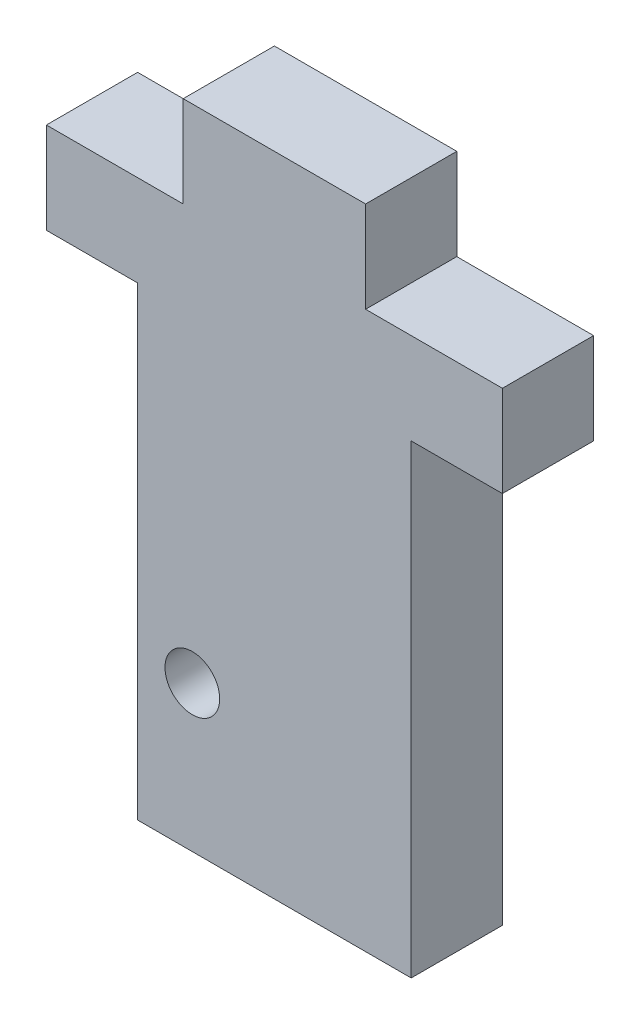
ISO-10303-21;
HEADER;
FILE_DESCRIPTION(('STEP AP214'),'2;1');
FILE_NAME('part.step','',(''),(''),'','','');
FILE_SCHEMA(('AUTOMOTIVE_DESIGN { 1 0 10303 214 1 1 1 1 }'));
ENDSEC;
DATA;
#1=APPLICATION_CONTEXT('core data for automotive mechanical design processes');
#2=APPLICATION_PROTOCOL_DEFINITION('international standard','automotive_design',2000,#1);
#3=PRODUCT_CONTEXT('',#1,'mechanical');
#4=PRODUCT('Part','Part','',(#3));
#5=PRODUCT_RELATED_PRODUCT_CATEGORY('part','',(#4));
#6=PRODUCT_DEFINITION_FORMATION('','',#4);
#7=PRODUCT_DEFINITION_CONTEXT('part definition',#1,'design');
#8=PRODUCT_DEFINITION('design','',#6,#7);
#9=PRODUCT_DEFINITION_SHAPE('','',#8);
#10=(LENGTH_UNIT() NAMED_UNIT(*) SI_UNIT(.MILLI.,.METRE.));
#11=(NAMED_UNIT(*) PLANE_ANGLE_UNIT() SI_UNIT($,.RADIAN.));
#12=(NAMED_UNIT(*) SI_UNIT($,.STERADIAN.) SOLID_ANGLE_UNIT());
#13=UNCERTAINTY_MEASURE_WITH_UNIT(LENGTH_MEASURE(1.E-05),#10,'distance_accuracy_value','');
#14=(GEOMETRIC_REPRESENTATION_CONTEXT(3) GLOBAL_UNCERTAINTY_ASSIGNED_CONTEXT((#13)) GLOBAL_UNIT_ASSIGNED_CONTEXT((#10,
#11,#12)) REPRESENTATION_CONTEXT('',''));
#15=CARTESIAN_POINT('',(0.,0.,0.));
#16=DIRECTION('',(0.,0.,1.));
#17=DIRECTION('',(1.,0.,0.));
#18=AXIS2_PLACEMENT_3D('',#15,#16,#17);
#19=CARTESIAN_POINT('',(12.5,17.75,5.));
#20=DIRECTION('',(-1.,0.,0.));
#21=DIRECTION('',(0.,-1.,0.));
#22=AXIS2_PLACEMENT_3D('',#19,#20,#21);
#23=PLANE('',#22);
#24=DIRECTION('',(0.,1.,0.));
#25=VECTOR('',#24,1.);
#26=CARTESIAN_POINT('',(12.5,17.75,5.));
#27=LINE('',#26,#25);
#28=CARTESIAN_POINT('',(12.5,7.75,5.));
#29=VERTEX_POINT('',#28);
#30=CARTESIAN_POINT('',(12.5,12.75,5.));
#31=VERTEX_POINT('',#30);
#32=EDGE_CURVE('E192',#29,#31,#27,.T.);
#33=ORIENTED_EDGE('',*,*,#32,.F.);
#34=DIRECTION('',(0.,0.,1.));
#35=VECTOR('',#34,1.);
#36=CARTESIAN_POINT('',(12.5,7.75,-0.00100000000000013));
#37=LINE('',#36,#35);
#38=CARTESIAN_POINT('',(12.5,7.75,0.));
#39=VERTEX_POINT('',#38);
#40=EDGE_CURVE('E150',#39,#29,#37,.T.);
#41=ORIENTED_EDGE('',*,*,#40,.F.);
#42=DIRECTION('',(0.,1.,0.));
#43=VECTOR('',#42,1.);
#44=CARTESIAN_POINT('',(12.5,17.75,0.));
#45=LINE('',#44,#43);
#46=CARTESIAN_POINT('',(12.5,12.75,0.));
#47=VERTEX_POINT('',#46);
#48=EDGE_CURVE('E174',#39,#47,#45,.T.);
#49=ORIENTED_EDGE('',*,*,#48,.T.);
#50=DIRECTION('',(0.,0.,1.));
#51=VECTOR('',#50,1.);
#52=CARTESIAN_POINT('',(12.5,12.75,-0.00100000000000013));
#53=LINE('',#52,#51);
#54=EDGE_CURVE('E160',#47,#31,#53,.T.);
#55=ORIENTED_EDGE('',*,*,#54,.T.);
#56=EDGE_LOOP('',(#33,#41,#49,#55));
#57=FACE_BOUND('',#56,.T.);
#58=ADVANCED_FACE('F34',(#57),#23,.F.);
#59=CARTESIAN_POINT('',(-12.5,17.75,5.));
#60=DIRECTION('',(0.,-1.,0.));
#61=DIRECTION('',(0.,0.,-1.));
#62=AXIS2_PLACEMENT_3D('',#59,#60,#61);
#63=PLANE('',#62);
#64=DIRECTION('',(-1.,0.,0.));
#65=VECTOR('',#64,1.);
#66=CARTESIAN_POINT('',(-12.5,17.75,0.));
#67=LINE('',#66,#65);
#68=CARTESIAN_POINT('',(5.,17.75,0.));
#69=VERTEX_POINT('',#68);
#70=CARTESIAN_POINT('',(-5.,17.75,0.));
#71=VERTEX_POINT('',#70);
#72=EDGE_CURVE('E199',#69,#71,#67,.T.);
#73=ORIENTED_EDGE('',*,*,#72,.T.);
#74=DIRECTION('',(0.,0.,1.));
#75=VECTOR('',#74,1.);
#76=CARTESIAN_POINT('',(-5.,17.75,-0.00100000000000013));
#77=LINE('',#76,#75);
#78=CARTESIAN_POINT('',(-5.,17.75,5.));
#79=VERTEX_POINT('',#78);
#80=EDGE_CURVE('E166',#71,#79,#77,.T.);
#81=ORIENTED_EDGE('',*,*,#80,.T.);
#82=DIRECTION('',(-1.,0.,0.));
#83=VECTOR('',#82,1.);
#84=CARTESIAN_POINT('',(-12.5,17.75,5.));
#85=LINE('',#84,#83);
#86=CARTESIAN_POINT('',(5.,17.75,5.));
#87=VERTEX_POINT('',#86);
#88=EDGE_CURVE('E194',#87,#79,#85,.T.);
#89=ORIENTED_EDGE('',*,*,#88,.F.);
#90=DIRECTION('',(0.,0.,1.));
#91=VECTOR('',#90,1.);
#92=CARTESIAN_POINT('',(5.,17.75,-0.00100000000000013));
#93=LINE('',#92,#91);
#94=EDGE_CURVE('E186',#69,#87,#93,.T.);
#95=ORIENTED_EDGE('',*,*,#94,.F.);
#96=EDGE_LOOP('',(#73,#81,#89,#95));
#97=FACE_BOUND('',#96,.T.);
#98=ADVANCED_FACE('F245',(#97),#63,.F.);
#99=CARTESIAN_POINT('',(-12.5,17.75,5.));
#100=DIRECTION('',(1.,0.,0.));
#101=DIRECTION('',(0.,1.,0.));
#102=AXIS2_PLACEMENT_3D('',#99,#100,#101);
#103=PLANE('',#102);
#104=DIRECTION('',(0.,-1.,0.));
#105=VECTOR('',#104,1.);
#106=CARTESIAN_POINT('',(-12.5,17.75,0.));
#107=LINE('',#106,#105);
#108=CARTESIAN_POINT('',(-12.5,12.75,0.));
#109=VERTEX_POINT('',#108);
#110=CARTESIAN_POINT('',(-12.5,7.75,0.));
#111=VERTEX_POINT('',#110);
#112=EDGE_CURVE('E201',#109,#111,#107,.T.);
#113=ORIENTED_EDGE('',*,*,#112,.T.);
#114=DIRECTION('',(0.,0.,1.));
#115=VECTOR('',#114,1.);
#116=CARTESIAN_POINT('',(-12.5,7.75,-0.00100000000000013));
#117=LINE('',#116,#115);
#118=CARTESIAN_POINT('',(-12.5,7.75,5.));
#119=VERTEX_POINT('',#118);
#120=EDGE_CURVE('E178',#111,#119,#117,.T.);
#121=ORIENTED_EDGE('',*,*,#120,.T.);
#122=DIRECTION('',(0.,-1.,0.));
#123=VECTOR('',#122,1.);
#124=CARTESIAN_POINT('',(-12.5,17.75,5.));
#125=LINE('',#124,#123);
#126=CARTESIAN_POINT('',(-12.5,12.75,5.));
#127=VERTEX_POINT('',#126);
#128=EDGE_CURVE('E42',#127,#119,#125,.T.);
#129=ORIENTED_EDGE('',*,*,#128,.F.);
#130=DIRECTION('',(0.,0.,1.));
#131=VECTOR('',#130,1.);
#132=CARTESIAN_POINT('',(-12.5,12.75,-0.00100000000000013));
#133=LINE('',#132,#131);
#134=EDGE_CURVE('E165',#109,#127,#133,.T.);
#135=ORIENTED_EDGE('',*,*,#134,.F.);
#136=EDGE_LOOP('',(#113,#121,#129,#135));
#137=FACE_BOUND('',#136,.T.);
#138=ADVANCED_FACE('F207',(#137),#103,.F.);
#139=CARTESIAN_POINT('',(-12.5,-17.75,5.));
#140=DIRECTION('',(0.,1.,0.));
#141=DIRECTION('',(0.,0.,1.));
#142=AXIS2_PLACEMENT_3D('',#139,#140,#141);
#143=PLANE('',#142);
#144=DIRECTION('',(1.,0.,0.));
#145=VECTOR('',#144,1.);
#146=CARTESIAN_POINT('',(-12.5,-17.75,5.));
#147=LINE('',#146,#145);
#148=CARTESIAN_POINT('',(-7.5,-17.75,5.));
#149=VERTEX_POINT('',#148);
#150=CARTESIAN_POINT('',(7.50000000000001,-17.75,5.));
#151=VERTEX_POINT('',#150);
#152=EDGE_CURVE('E11',#149,#151,#147,.T.);
#153=ORIENTED_EDGE('',*,*,#152,.F.);
#154=DIRECTION('',(0.,0.,1.));
#155=VECTOR('',#154,1.);
#156=CARTESIAN_POINT('',(-7.5,-17.75,-0.00100000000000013));
#157=LINE('',#156,#155);
#158=CARTESIAN_POINT('',(-7.5,-17.75,0.));
#159=VERTEX_POINT('',#158);
#160=EDGE_CURVE('E124',#159,#149,#157,.T.);
#161=ORIENTED_EDGE('',*,*,#160,.F.);
#162=DIRECTION('',(1.,0.,0.));
#163=VECTOR('',#162,1.);
#164=CARTESIAN_POINT('',(-12.5,-17.75,0.));
#165=LINE('',#164,#163);
#166=CARTESIAN_POINT('',(7.50000000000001,-17.75,0.));
#167=VERTEX_POINT('',#166);
#168=EDGE_CURVE('E37',#159,#167,#165,.T.);
#169=ORIENTED_EDGE('',*,*,#168,.T.);
#170=DIRECTION('',(0.,0.,1.));
#171=VECTOR('',#170,1.);
#172=CARTESIAN_POINT('',(7.50000000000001,-17.75,-0.00100000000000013));
#173=LINE('',#172,#171);
#174=EDGE_CURVE('E145',#167,#151,#173,.T.);
#175=ORIENTED_EDGE('',*,*,#174,.T.);
#176=EDGE_LOOP('',(#153,#161,#169,#175));
#177=FACE_BOUND('',#176,.T.);
#178=ADVANCED_FACE('F144',(#177),#143,.F.);
#179=CARTESIAN_POINT('',(0.,0.,5.));
#180=DIRECTION('',(0.,0.,1.));
#181=DIRECTION('',(1.,0.,0.));
#182=AXIS2_PLACEMENT_3D('',#179,#180,#181);
#183=PLANE('',#182);
#184=CARTESIAN_POINT('',(-4.5,-9.75,5.));
#185=DIRECTION('',(0.,0.,1.));
#186=DIRECTION('',(1.,0.,0.));
#187=AXIS2_PLACEMENT_3D('',#184,#185,#186);
#188=CIRCLE('',#187,1.5);
#189=CARTESIAN_POINT('',(-3.,-9.75,5.));
#190=VERTEX_POINT('',#189);
#191=EDGE_CURVE('E373',#190,#190,#188,.T.);
#192=ORIENTED_EDGE('',*,*,#191,.F.);
#193=EDGE_LOOP('',(#192));
#194=FACE_BOUND('',#193,.T.);
#195=DIRECTION('',(-1.,0.,0.));
#196=VECTOR('',#195,1.);
#197=CARTESIAN_POINT('',(-12.5,7.75,5.));
#198=LINE('',#197,#196);
#199=CARTESIAN_POINT('',(-7.5,7.75,5.));
#200=VERTEX_POINT('',#199);
#201=EDGE_CURVE('E136',#200,#119,#198,.T.);
#202=ORIENTED_EDGE('',*,*,#201,.F.);
#203=DIRECTION('',(0.,1.,0.));
#204=VECTOR('',#203,1.);
#205=CARTESIAN_POINT('',(-7.5,7.75,5.));
#206=LINE('',#205,#204);
#207=EDGE_CURVE('E127',#149,#200,#206,.T.);
#208=ORIENTED_EDGE('',*,*,#207,.F.);
#209=ORIENTED_EDGE('',*,*,#152,.T.);
#210=DIRECTION('',(0.,-1.,0.));
#211=VECTOR('',#210,1.);
#212=CARTESIAN_POINT('',(7.5,7.75,5.));
#213=LINE('',#212,#211);
#214=CARTESIAN_POINT('',(7.5,7.75,5.));
#215=VERTEX_POINT('',#214);
#216=EDGE_CURVE('E153',#215,#151,#213,.T.);
#217=ORIENTED_EDGE('',*,*,#216,.F.);
#218=DIRECTION('',(-1.,0.,0.));
#219=VECTOR('',#218,1.);
#220=CARTESIAN_POINT('',(12.5,7.75,5.));
#221=LINE('',#220,#219);
#222=EDGE_CURVE('E220',#29,#215,#221,.T.);
#223=ORIENTED_EDGE('',*,*,#222,.F.);
#224=ORIENTED_EDGE('',*,*,#32,.T.);
#225=DIRECTION('',(1.,0.,0.));
#226=VECTOR('',#225,1.);
#227=CARTESIAN_POINT('',(12.5,12.75,5.));
#228=LINE('',#227,#226);
#229=CARTESIAN_POINT('',(5.,12.75,5.));
#230=VERTEX_POINT('',#229);
#231=EDGE_CURVE('E183',#230,#31,#228,.T.);
#232=ORIENTED_EDGE('',*,*,#231,.F.);
#233=DIRECTION('',(0.,-1.,0.));
#234=VECTOR('',#233,1.);
#235=CARTESIAN_POINT('',(5.,17.75,5.));
#236=LINE('',#235,#234);
#237=EDGE_CURVE('E180',#87,#230,#236,.T.);
#238=ORIENTED_EDGE('',*,*,#237,.F.);
#239=ORIENTED_EDGE('',*,*,#88,.T.);
#240=DIRECTION('',(0.,1.,0.));
#241=VECTOR('',#240,1.);
#242=CARTESIAN_POINT('',(-5.,17.75,5.));
#243=LINE('',#242,#241);
#244=CARTESIAN_POINT('',(-5.,12.75,5.));
#245=VERTEX_POINT('',#244);
#246=EDGE_CURVE('E163',#245,#79,#243,.T.);
#247=ORIENTED_EDGE('',*,*,#246,.F.);
#248=DIRECTION('',(1.,0.,0.));
#249=VECTOR('',#248,1.);
#250=CARTESIAN_POINT('',(-12.5,12.75,5.));
#251=LINE('',#250,#249);
#252=EDGE_CURVE('E159',#127,#245,#251,.T.);
#253=ORIENTED_EDGE('',*,*,#252,.F.);
#254=ORIENTED_EDGE('',*,*,#128,.T.);
#255=EDGE_LOOP('',(#202,#208,#209,#217,#223,#224,#232,#238,#239,#247,#253,#254));
#256=FACE_BOUND('',#255,.T.);
#257=ADVANCED_FACE('F139',(#194,#256),#183,.T.);
#258=CARTESIAN_POINT('',(0.,0.,0.));
#259=DIRECTION('',(0.,0.,1.));
#260=DIRECTION('',(1.,0.,0.));
#261=AXIS2_PLACEMENT_3D('',#258,#259,#260);
#262=PLANE('',#261);
#263=CARTESIAN_POINT('',(-4.5,-9.75,0.));
#264=DIRECTION('',(0.,0.,1.));
#265=DIRECTION('',(1.,0.,0.));
#266=AXIS2_PLACEMENT_3D('',#263,#264,#265);
#267=CIRCLE('',#266,1.5);
#268=CARTESIAN_POINT('',(-3.,-9.75,0.));
#269=VERTEX_POINT('',#268);
#270=EDGE_CURVE('E221',#269,#269,#267,.F.);
#271=ORIENTED_EDGE('',*,*,#270,.F.);
#272=EDGE_LOOP('',(#271));
#273=FACE_BOUND('',#272,.T.);
#274=DIRECTION('',(0.,-1.,0.));
#275=VECTOR('',#274,1.);
#276=CARTESIAN_POINT('',(-7.5,7.75,0.));
#277=LINE('',#276,#275);
#278=CARTESIAN_POINT('',(-7.5,7.75,0.));
#279=VERTEX_POINT('',#278);
#280=EDGE_CURVE('E130',#279,#159,#277,.T.);
#281=ORIENTED_EDGE('',*,*,#280,.F.);
#282=DIRECTION('',(1.,0.,0.));
#283=VECTOR('',#282,1.);
#284=CARTESIAN_POINT('',(-12.5,7.75,0.));
#285=LINE('',#284,#283);
#286=EDGE_CURVE('E50',#111,#279,#285,.T.);
#287=ORIENTED_EDGE('',*,*,#286,.F.);
#288=ORIENTED_EDGE('',*,*,#112,.F.);
#289=DIRECTION('',(-1.,0.,0.));
#290=VECTOR('',#289,1.);
#291=CARTESIAN_POINT('',(-12.5,12.75,0.));
#292=LINE('',#291,#290);
#293=CARTESIAN_POINT('',(-5.,12.75,0.));
#294=VERTEX_POINT('',#293);
#295=EDGE_CURVE('E169',#294,#109,#292,.T.);
#296=ORIENTED_EDGE('',*,*,#295,.F.);
#297=DIRECTION('',(0.,-1.,0.));
#298=VECTOR('',#297,1.);
#299=CARTESIAN_POINT('',(-5.,17.75,0.));
#300=LINE('',#299,#298);
#301=EDGE_CURVE('E157',#71,#294,#300,.T.);
#302=ORIENTED_EDGE('',*,*,#301,.F.);
#303=ORIENTED_EDGE('',*,*,#72,.F.);
#304=DIRECTION('',(0.,1.,0.));
#305=VECTOR('',#304,1.);
#306=CARTESIAN_POINT('',(5.,17.75,0.));
#307=LINE('',#306,#305);
#308=CARTESIAN_POINT('',(5.,12.75,0.));
#309=VERTEX_POINT('',#308);
#310=EDGE_CURVE('E175',#309,#69,#307,.T.);
#311=ORIENTED_EDGE('',*,*,#310,.F.);
#312=DIRECTION('',(-1.,0.,0.));
#313=VECTOR('',#312,1.);
#314=CARTESIAN_POINT('',(12.5,12.75,0.));
#315=LINE('',#314,#313);
#316=EDGE_CURVE('E177',#47,#309,#315,.T.);
#317=ORIENTED_EDGE('',*,*,#316,.F.);
#318=ORIENTED_EDGE('',*,*,#48,.F.);
#319=DIRECTION('',(1.,0.,0.));
#320=VECTOR('',#319,1.);
#321=CARTESIAN_POINT('',(12.5,7.75,0.));
#322=LINE('',#321,#320);
#323=CARTESIAN_POINT('',(7.5,7.75,0.));
#324=VERTEX_POINT('',#323);
#325=EDGE_CURVE('E146',#324,#39,#322,.T.);
#326=ORIENTED_EDGE('',*,*,#325,.F.);
#327=DIRECTION('',(0.,1.,0.));
#328=VECTOR('',#327,1.);
#329=CARTESIAN_POINT('',(7.5,7.75,0.));
#330=LINE('',#329,#328);
#331=EDGE_CURVE('E58',#167,#324,#330,.T.);
#332=ORIENTED_EDGE('',*,*,#331,.F.);
#333=ORIENTED_EDGE('',*,*,#168,.F.);
#334=EDGE_LOOP('',(#281,#287,#288,#296,#302,#303,#311,#317,#318,#326,#332,#333));
#335=FACE_BOUND('',#334,.T.);
#336=ADVANCED_FACE('F211',(#273,#335),#262,.F.);
#337=CARTESIAN_POINT('',(12.5,12.75,-0.00100000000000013));
#338=DIRECTION('',(0.,-1.,0.));
#339=DIRECTION('',(1.,0.,0.));
#340=AXIS2_PLACEMENT_3D('',#337,#338,#339);
#341=PLANE('',#340);
#342=ORIENTED_EDGE('',*,*,#316,.T.);
#343=DIRECTION('',(0.,0.,1.));
#344=VECTOR('',#343,1.);
#345=CARTESIAN_POINT('',(5.,12.75,-0.00100000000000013));
#346=LINE('',#345,#344);
#347=EDGE_CURVE('E189',#309,#230,#346,.T.);
#348=ORIENTED_EDGE('',*,*,#347,.T.);
#349=ORIENTED_EDGE('',*,*,#231,.T.);
#350=ORIENTED_EDGE('',*,*,#54,.F.);
#351=EDGE_LOOP('',(#342,#348,#349,#350));
#352=FACE_BOUND('',#351,.T.);
#353=ADVANCED_FACE('F234',(#352),#341,.F.);
#354=CARTESIAN_POINT('',(5.,17.75,-0.00100000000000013));
#355=DIRECTION('',(-1.,0.,0.));
#356=DIRECTION('',(0.,0.,1.));
#357=AXIS2_PLACEMENT_3D('',#354,#355,#356);
#358=PLANE('',#357);
#359=ORIENTED_EDGE('',*,*,#310,.T.);
#360=ORIENTED_EDGE('',*,*,#94,.T.);
#361=ORIENTED_EDGE('',*,*,#237,.T.);
#362=ORIENTED_EDGE('',*,*,#347,.F.);
#363=EDGE_LOOP('',(#359,#360,#361,#362));
#364=FACE_BOUND('',#363,.T.);
#365=ADVANCED_FACE('F241',(#364),#358,.F.);
#366=CARTESIAN_POINT('',(-5.,17.75,-0.00100000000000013));
#367=DIRECTION('',(1.,0.,0.));
#368=DIRECTION('',(0.,0.,-1.));
#369=AXIS2_PLACEMENT_3D('',#366,#367,#368);
#370=PLANE('',#369);
#371=ORIENTED_EDGE('',*,*,#301,.T.);
#372=DIRECTION('',(0.,0.,1.));
#373=VECTOR('',#372,1.);
#374=CARTESIAN_POINT('',(-5.,12.75,-0.00100000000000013));
#375=LINE('',#374,#373);
#376=EDGE_CURVE('E170',#294,#245,#375,.T.);
#377=ORIENTED_EDGE('',*,*,#376,.T.);
#378=ORIENTED_EDGE('',*,*,#246,.T.);
#379=ORIENTED_EDGE('',*,*,#80,.F.);
#380=EDGE_LOOP('',(#371,#377,#378,#379));
#381=FACE_BOUND('',#380,.T.);
#382=ADVANCED_FACE('F249',(#381),#370,.F.);
#383=CARTESIAN_POINT('',(-12.5,12.75,-0.00100000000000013));
#384=DIRECTION('',(0.,-1.,0.));
#385=DIRECTION('',(0.,0.,-1.));
#386=AXIS2_PLACEMENT_3D('',#383,#384,#385);
#387=PLANE('',#386);
#388=ORIENTED_EDGE('',*,*,#295,.T.);
#389=ORIENTED_EDGE('',*,*,#134,.T.);
#390=ORIENTED_EDGE('',*,*,#252,.T.);
#391=ORIENTED_EDGE('',*,*,#376,.F.);
#392=EDGE_LOOP('',(#388,#389,#390,#391));
#393=FACE_BOUND('',#392,.T.);
#394=ADVANCED_FACE('F252',(#393),#387,.F.);
#395=CARTESIAN_POINT('',(7.5,7.75,-0.00100000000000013));
#396=DIRECTION('',(-1.,0.,0.));
#397=DIRECTION('',(0.,-1.,0.));
#398=AXIS2_PLACEMENT_3D('',#395,#396,#397);
#399=PLANE('',#398);
#400=ORIENTED_EDGE('',*,*,#331,.T.);
#401=DIRECTION('',(0.,0.,1.));
#402=VECTOR('',#401,1.);
#403=CARTESIAN_POINT('',(7.5,7.75,-0.00100000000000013));
#404=LINE('',#403,#402);
#405=EDGE_CURVE('E147',#324,#215,#404,.T.);
#406=ORIENTED_EDGE('',*,*,#405,.T.);
#407=ORIENTED_EDGE('',*,*,#216,.T.);
#408=ORIENTED_EDGE('',*,*,#174,.F.);
#409=EDGE_LOOP('',(#400,#406,#407,#408));
#410=FACE_BOUND('',#409,.T.);
#411=ADVANCED_FACE('F225',(#410),#399,.F.);
#412=CARTESIAN_POINT('',(12.5,7.75,-0.00100000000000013));
#413=DIRECTION('',(0.,1.,0.));
#414=DIRECTION('',(0.,0.,1.));
#415=AXIS2_PLACEMENT_3D('',#412,#413,#414);
#416=PLANE('',#415);
#417=ORIENTED_EDGE('',*,*,#325,.T.);
#418=ORIENTED_EDGE('',*,*,#40,.T.);
#419=ORIENTED_EDGE('',*,*,#222,.T.);
#420=ORIENTED_EDGE('',*,*,#405,.F.);
#421=EDGE_LOOP('',(#417,#418,#419,#420));
#422=FACE_BOUND('',#421,.T.);
#423=ADVANCED_FACE('F259',(#422),#416,.F.);
#424=CARTESIAN_POINT('',(-12.5,7.75,-0.00100000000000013));
#425=DIRECTION('',(0.,1.,0.));
#426=DIRECTION('',(-1.,0.,0.));
#427=AXIS2_PLACEMENT_3D('',#424,#425,#426);
#428=PLANE('',#427);
#429=ORIENTED_EDGE('',*,*,#286,.T.);
#430=DIRECTION('',(0.,0.,1.));
#431=VECTOR('',#430,1.);
#432=CARTESIAN_POINT('',(-7.5,7.75,-0.00100000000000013));
#433=LINE('',#432,#431);
#434=EDGE_CURVE('E135',#279,#200,#433,.T.);
#435=ORIENTED_EDGE('',*,*,#434,.T.);
#436=ORIENTED_EDGE('',*,*,#201,.T.);
#437=ORIENTED_EDGE('',*,*,#120,.F.);
#438=EDGE_LOOP('',(#429,#435,#436,#437));
#439=FACE_BOUND('',#438,.T.);
#440=ADVANCED_FACE('F331',(#439),#428,.F.);
#441=CARTESIAN_POINT('',(-7.5,7.75,-0.00100000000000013));
#442=DIRECTION('',(1.,0.,0.));
#443=DIRECTION('',(0.,1.,0.));
#444=AXIS2_PLACEMENT_3D('',#441,#442,#443);
#445=PLANE('',#444);
#446=ORIENTED_EDGE('',*,*,#280,.T.);
#447=ORIENTED_EDGE('',*,*,#160,.T.);
#448=ORIENTED_EDGE('',*,*,#207,.T.);
#449=ORIENTED_EDGE('',*,*,#434,.F.);
#450=EDGE_LOOP('',(#446,#447,#448,#449));
#451=FACE_BOUND('',#450,.T.);
#452=ADVANCED_FACE('F126',(#451),#445,.F.);
#453=CARTESIAN_POINT('',(-4.5,-9.75,-0.00100000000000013));
#454=DIRECTION('',(0.,0.,1.));
#455=DIRECTION('',(1.,0.,0.));
#456=AXIS2_PLACEMENT_3D('',#453,#454,#455);
#457=CYLINDRICAL_SURFACE('',#456,1.5);
#458=ORIENTED_EDGE('',*,*,#191,.T.);
#459=EDGE_LOOP('',(#458));
#460=FACE_BOUND('',#459,.T.);
#461=ORIENTED_EDGE('',*,*,#270,.T.);
#462=EDGE_LOOP('',(#461));
#463=FACE_BOUND('',#462,.T.);
#464=ADVANCED_FACE('F348',(#460,#463),#457,.F.);
#465=CLOSED_SHELL('',(#58,#98,#138,#178,#257,#336,#353,#365,#382,#394,#411,#423,#440,#452,#464));
#466=MANIFOLD_SOLID_BREP('B2',#465);
#467=ADVANCED_BREP_SHAPE_REPRESENTATION('',(#18,#466),#14);
#468=SHAPE_DEFINITION_REPRESENTATION(#9,#467);
ENDSEC;
END-ISO-10303-21;
